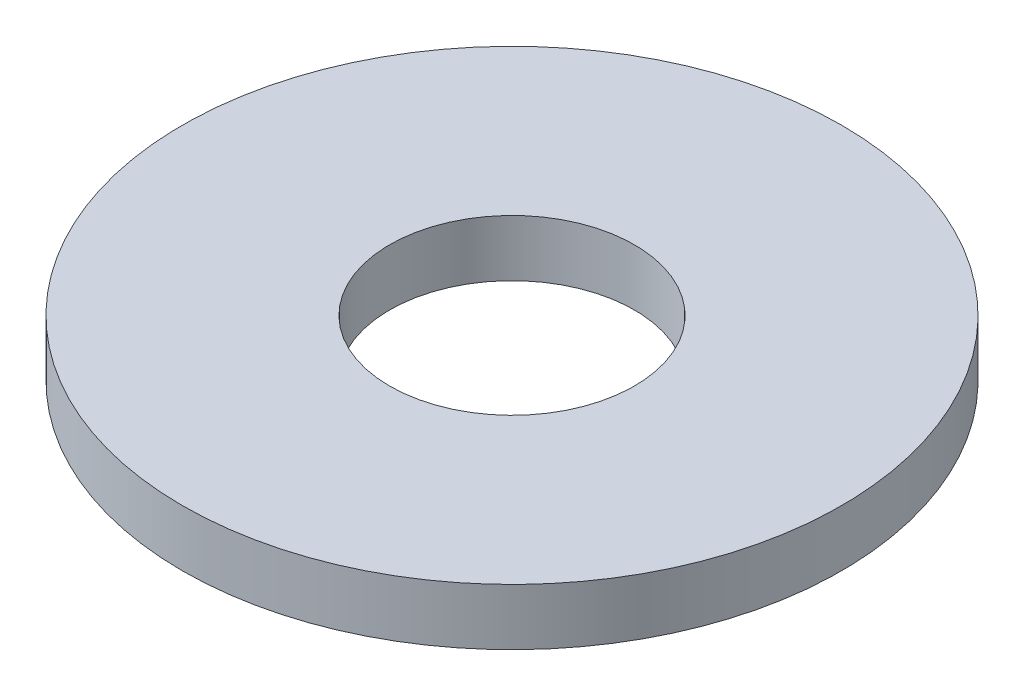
from build123d import *

# Parameters (mm, degrees)
SKETCH1_R      = 1.75
SKETCH1_R_2    = 0.65
EXTRUDE1_DEPTH = 0.3


with BuildPart() as part:
    # Sketch1 → Extrude1 (new body)
    with BuildSketch(Plane(origin=(0, 0, 0), x_dir=(1, 0, 0), z_dir=(0, 1, 0))):
        with Locations(Location((0, 0, 0), (0, 0, 270))):
            Circle(SKETCH1_R)
        with Locations(Location((0, 0, 0), (0, 0, 270))):
            Circle(SKETCH1_R_2, mode=Mode.SUBTRACT)
    extrude(amount=EXTRUDE1_DEPTH)


solid = part.part
